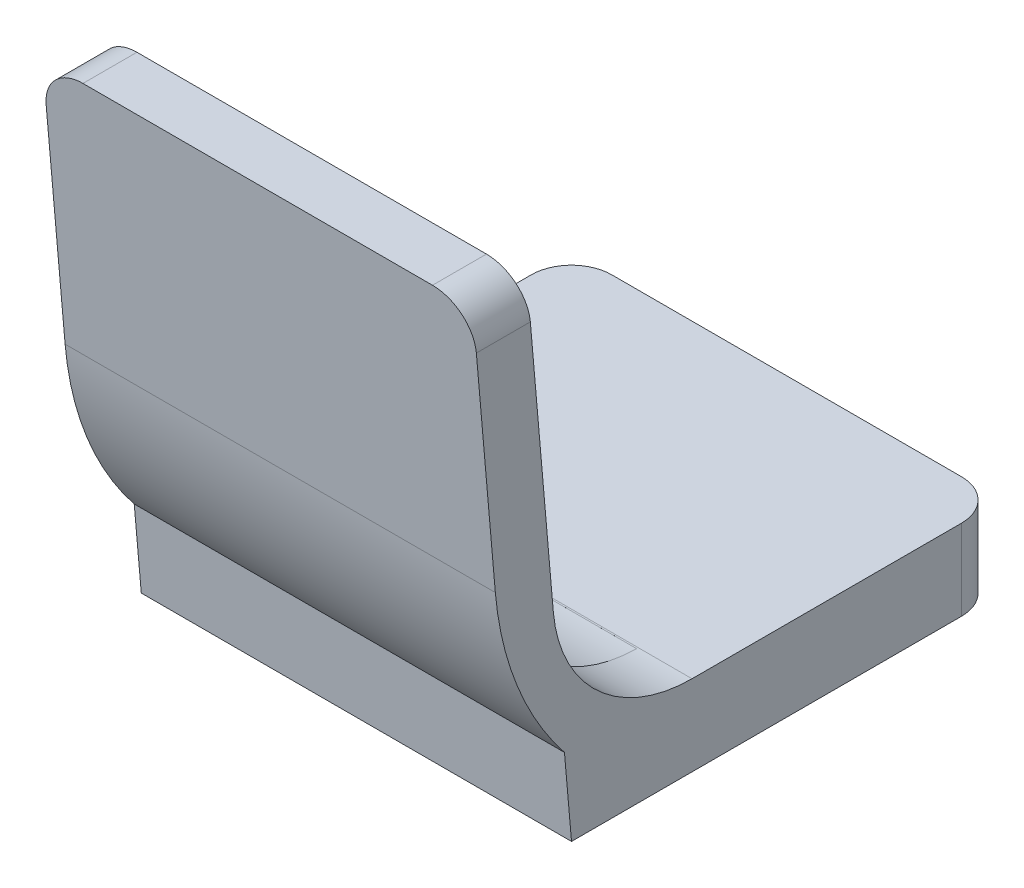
ISO-10303-21;
HEADER;
FILE_DESCRIPTION(('STEP AP214'),'2;1');
FILE_NAME('part.step','',(''),(''),'','','');
FILE_SCHEMA(('AUTOMOTIVE_DESIGN { 1 0 10303 214 1 1 1 1 }'));
ENDSEC;
DATA;
#1=APPLICATION_CONTEXT('core data for automotive mechanical design processes');
#2=APPLICATION_PROTOCOL_DEFINITION('international standard','automotive_design',2000,#1);
#3=PRODUCT_CONTEXT('',#1,'mechanical');
#4=PRODUCT('Part','Part','',(#3));
#5=PRODUCT_RELATED_PRODUCT_CATEGORY('part','',(#4));
#6=PRODUCT_DEFINITION_FORMATION('','',#4);
#7=PRODUCT_DEFINITION_CONTEXT('part definition',#1,'design');
#8=PRODUCT_DEFINITION('design','',#6,#7);
#9=PRODUCT_DEFINITION_SHAPE('','',#8);
#10=(LENGTH_UNIT() NAMED_UNIT(*) SI_UNIT(.MILLI.,.METRE.));
#11=(NAMED_UNIT(*) PLANE_ANGLE_UNIT() SI_UNIT($,.RADIAN.));
#12=(NAMED_UNIT(*) SI_UNIT($,.STERADIAN.) SOLID_ANGLE_UNIT());
#13=UNCERTAINTY_MEASURE_WITH_UNIT(LENGTH_MEASURE(1.E-05),#10,'distance_accuracy_value','');
#14=(GEOMETRIC_REPRESENTATION_CONTEXT(3) GLOBAL_UNCERTAINTY_ASSIGNED_CONTEXT((#13)) GLOBAL_UNIT_ASSIGNED_CONTEXT((#10,
#11,#12)) REPRESENTATION_CONTEXT('',''));
#15=CARTESIAN_POINT('',(0.,0.,0.));
#16=DIRECTION('',(0.,0.,1.));
#17=DIRECTION('',(1.,0.,0.));
#18=AXIS2_PLACEMENT_3D('',#15,#16,#17);
#19=CARTESIAN_POINT('',(8.,5.17827203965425,-4.48254610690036));
#20=DIRECTION('',(-1.,0.,0.));
#21=DIRECTION('',(0.,0.,1.));
#22=AXIS2_PLACEMENT_3D('',#19,#20,#21);
#23=CYLINDRICAL_SURFACE('',#22,5.17827203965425);
#24=CARTESIAN_POINT('',(-6.,5.17827203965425,-4.48254610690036));
#25=DIRECTION('',(1.,0.,0.));
#26=DIRECTION('',(0.,0.,-1.));
#27=AXIS2_PLACEMENT_3D('',#24,#25,#26);
#28=CIRCLE('',#27,5.17827203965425);
#29=CARTESIAN_POINT('',(-6.,0.000374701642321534,-4.42025265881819));
#30=VERTEX_POINT('',#29);
#31=CARTESIAN_POINT('',(-6.,4.72695589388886,0.676021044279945));
#32=VERTEX_POINT('',#31);
#33=EDGE_CURVE('E226',#30,#32,#28,.F.);
#34=ORIENTED_EDGE('',*,*,#33,.F.);
#35=DIRECTION('',(-1.,0.,0.));
#36=VECTOR('',#35,1.);
#37=CARTESIAN_POINT('',(8.,0.000374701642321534,-4.42025265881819));
#38=LINE('',#37,#36);
#39=CARTESIAN_POINT('',(6.,0.000374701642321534,-4.42025265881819));
#40=VERTEX_POINT('',#39);
#41=EDGE_CURVE('E219',#30,#40,#38,.F.);
#42=ORIENTED_EDGE('',*,*,#41,.T.);
#43=CARTESIAN_POINT('',(6.,5.17827203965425,-4.48254610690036));
#44=DIRECTION('',(1.,0.,0.));
#45=DIRECTION('',(0.,0.,-1.));
#46=AXIS2_PLACEMENT_3D('',#43,#44,#45);
#47=CIRCLE('',#46,5.17827203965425);
#48=CARTESIAN_POINT('',(6.,4.72695589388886,0.676021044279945));
#49=VERTEX_POINT('',#48);
#50=EDGE_CURVE('E223',#40,#49,#47,.F.);
#51=ORIENTED_EDGE('',*,*,#50,.T.);
#52=DIRECTION('',(-1.,0.,0.));
#53=VECTOR('',#52,1.);
#54=CARTESIAN_POINT('',(8.,4.72695589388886,0.676021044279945));
#55=LINE('',#54,#53);
#56=CARTESIAN_POINT('',(8.,4.72695589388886,0.676021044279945));
#57=VERTEX_POINT('',#56);
#58=EDGE_CURVE('E322',#57,#49,#55,.T.);
#59=ORIENTED_EDGE('',*,*,#58,.F.);
#60=CARTESIAN_POINT('',(8.,5.17827203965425,-4.48254610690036));
#61=DIRECTION('',(-1.,0.,0.));
#62=DIRECTION('',(0.,0.,-1.));
#63=AXIS2_PLACEMENT_3D('',#60,#61,#62);
#64=CIRCLE('',#63,5.17827203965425);
#65=CARTESIAN_POINT('',(8.,0.,-4.48254610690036));
#66=VERTEX_POINT('',#65);
#67=EDGE_CURVE('E275',#66,#57,#64,.T.);
#68=ORIENTED_EDGE('',*,*,#67,.F.);
#69=DIRECTION('',(-1.,0.,0.));
#70=VECTOR('',#69,1.);
#71=CARTESIAN_POINT('',(8.,0.,-4.48254610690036));
#72=LINE('',#71,#70);
#73=CARTESIAN_POINT('',(-8.,0.,-4.48254610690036));
#74=VERTEX_POINT('',#73);
#75=EDGE_CURVE('E325',#66,#74,#72,.T.);
#76=ORIENTED_EDGE('',*,*,#75,.T.);
#77=CARTESIAN_POINT('',(-8.,5.17827203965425,-4.48254610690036));
#78=DIRECTION('',(-1.,0.,0.));
#79=DIRECTION('',(0.,0.,-1.));
#80=AXIS2_PLACEMENT_3D('',#77,#78,#79);
#81=CIRCLE('',#80,5.17827203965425);
#82=CARTESIAN_POINT('',(-8.,4.72695589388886,0.676021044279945));
#83=VERTEX_POINT('',#82);
#84=EDGE_CURVE('E292',#74,#83,#81,.T.);
#85=ORIENTED_EDGE('',*,*,#84,.T.);
#86=EDGE_CURVE('E321',#32,#83,#55,.T.);
#87=ORIENTED_EDGE('',*,*,#86,.F.);
#88=EDGE_LOOP('',(#34,#42,#51,#59,#68,#76,#85,#87));
#89=FACE_BOUND('',#88,.T.);
#90=ADVANCED_FACE('F34',(#89),#23,.F.);
#91=CARTESIAN_POINT('',(8.,4.72695589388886,0.676021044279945));
#92=DIRECTION('',(0.,-0.0871557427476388,0.996194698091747));
#93=DIRECTION('',(0.,-0.996194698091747,-0.0871557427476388));
#94=AXIS2_PLACEMENT_3D('',#91,#92,#93);
#95=PLANE('',#94);
#96=DIRECTION('',(0.,0.996194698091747,0.0871557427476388));
#97=VECTOR('',#96,1.);
#98=CARTESIAN_POINT('',(-8.,4.72695589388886,0.676021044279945));
#99=LINE('',#98,#97);
#100=CARTESIAN_POINT('',(-8.,14.5,1.53105161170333));
#101=VERTEX_POINT('',#100);
#102=EDGE_CURVE('E295',#83,#101,#99,.T.);
#103=ORIENTED_EDGE('',*,*,#102,.T.);
#104=CARTESIAN_POINT('',(-6.5,14.5,1.53105161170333));
#105=DIRECTION('',(0.,-0.0871557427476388,0.996194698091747));
#106=DIRECTION('',(0.,0.996194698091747,0.0871557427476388));
#107=AXIS2_PLACEMENT_3D('',#104,#105,#106);
#108=ELLIPSE('',#107,1.50572975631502,1.5);
#109=CARTESIAN_POINT('',(-6.5,16.,1.66228460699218));
#110=VERTEX_POINT('',#109);
#111=EDGE_CURVE('E356',#101,#110,#108,.F.);
#112=ORIENTED_EDGE('',*,*,#111,.T.);
#113=DIRECTION('',(-1.,0.,0.));
#114=VECTOR('',#113,1.);
#115=CARTESIAN_POINT('',(8.,16.,1.66228460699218));
#116=LINE('',#115,#114);
#117=CARTESIAN_POINT('',(-6.,16.,1.66228460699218));
#118=VERTEX_POINT('',#117);
#119=EDGE_CURVE('E318',#118,#110,#116,.T.);
#120=ORIENTED_EDGE('',*,*,#119,.F.);
#121=DIRECTION('',(0.,0.996194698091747,0.0871557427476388));
#122=VECTOR('',#121,1.);
#123=CARTESIAN_POINT('',(-6.,4.72695589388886,0.676021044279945));
#124=LINE('',#123,#122);
#125=EDGE_CURVE('E203',#32,#118,#124,.T.);
#126=ORIENTED_EDGE('',*,*,#125,.F.);
#127=ORIENTED_EDGE('',*,*,#86,.T.);
#128=EDGE_LOOP('',(#103,#112,#120,#126,#127));
#129=FACE_BOUND('',#128,.T.);
#130=ADVANCED_FACE('F398',(#129),#95,.F.);
#131=CARTESIAN_POINT('',(8.,0.,-16.));
#132=DIRECTION('',(0.,0.,1.));
#133=DIRECTION('',(1.,0.,0.));
#134=AXIS2_PLACEMENT_3D('',#131,#132,#133);
#135=PLANE('',#134);
#136=DIRECTION('',(-1.,0.,0.));
#137=VECTOR('',#136,1.);
#138=CARTESIAN_POINT('',(8.,0.,-16.));
#139=LINE('',#138,#137);
#140=CARTESIAN_POINT('',(6.5,0.,-16.));
#141=VERTEX_POINT('',#140);
#142=CARTESIAN_POINT('',(-6.5,0.,-16.));
#143=VERTEX_POINT('',#142);
#144=EDGE_CURVE('E328',#141,#143,#139,.T.);
#145=ORIENTED_EDGE('',*,*,#144,.F.);
#146=DIRECTION('',(0.,1.,0.));
#147=VECTOR('',#146,1.);
#148=CARTESIAN_POINT('',(6.5,-3.,-16.));
#149=LINE('',#148,#147);
#150=CARTESIAN_POINT('',(6.5,-3.,-16.));
#151=VERTEX_POINT('',#150);
#152=EDGE_CURVE('E55',#141,#151,#149,.F.);
#153=ORIENTED_EDGE('',*,*,#152,.T.);
#154=DIRECTION('',(-1.,0.,0.));
#155=VECTOR('',#154,1.);
#156=CARTESIAN_POINT('',(8.,-3.,-16.));
#157=LINE('',#156,#155);
#158=CARTESIAN_POINT('',(-6.5,-3.,-16.));
#159=VERTEX_POINT('',#158);
#160=EDGE_CURVE('E290',#151,#159,#157,.T.);
#161=ORIENTED_EDGE('',*,*,#160,.T.);
#162=DIRECTION('',(0.,1.,0.));
#163=VECTOR('',#162,1.);
#164=CARTESIAN_POINT('',(-6.5,0.,-16.));
#165=LINE('',#164,#163);
#166=EDGE_CURVE('E362',#159,#143,#165,.T.);
#167=ORIENTED_EDGE('',*,*,#166,.T.);
#168=EDGE_LOOP('',(#145,#153,#161,#167));
#169=FACE_BOUND('',#168,.T.);
#170=ADVANCED_FACE('F366',(#169),#135,.F.);
#171=CARTESIAN_POINT('',(8.,0.,-16.));
#172=DIRECTION('',(0.,-1.,0.));
#173=DIRECTION('',(0.,0.,-1.));
#174=AXIS2_PLACEMENT_3D('',#171,#172,#173);
#175=PLANE('',#174);
#176=DIRECTION('',(0.,0.,1.));
#177=VECTOR('',#176,1.);
#178=CARTESIAN_POINT('',(8.,0.,-16.));
#179=LINE('',#178,#177);
#180=CARTESIAN_POINT('',(8.,0.,-14.5));
#181=VERTEX_POINT('',#180);
#182=EDGE_CURVE('E273',#181,#66,#179,.T.);
#183=ORIENTED_EDGE('',*,*,#182,.F.);
#184=CARTESIAN_POINT('',(6.5,0.,-14.5));
#185=DIRECTION('',(0.,-1.,0.));
#186=DIRECTION('',(0.,0.,-1.));
#187=AXIS2_PLACEMENT_3D('',#184,#185,#186);
#188=CIRCLE('',#187,1.5);
#189=EDGE_CURVE('E360',#181,#141,#188,.F.);
#190=ORIENTED_EDGE('',*,*,#189,.T.);
#191=ORIENTED_EDGE('',*,*,#144,.T.);
#192=CARTESIAN_POINT('',(-6.5,0.,-14.5));
#193=DIRECTION('',(0.,-1.,0.));
#194=DIRECTION('',(0.,0.,-1.));
#195=AXIS2_PLACEMENT_3D('',#192,#193,#194);
#196=CIRCLE('',#195,1.5);
#197=CARTESIAN_POINT('',(-8.,0.,-14.5));
#198=VERTEX_POINT('',#197);
#199=EDGE_CURVE('E358',#143,#198,#196,.F.);
#200=ORIENTED_EDGE('',*,*,#199,.T.);
#201=DIRECTION('',(0.,0.,1.));
#202=VECTOR('',#201,1.);
#203=CARTESIAN_POINT('',(-8.,0.,-16.));
#204=LINE('',#203,#202);
#205=EDGE_CURVE('E266',#198,#74,#204,.T.);
#206=ORIENTED_EDGE('',*,*,#205,.T.);
#207=ORIENTED_EDGE('',*,*,#75,.F.);
#208=EDGE_LOOP('',(#183,#190,#191,#200,#206,#207));
#209=FACE_BOUND('',#208,.T.);
#210=ADVANCED_FACE('F370',(#209),#175,.F.);
#211=CARTESIAN_POINT('',(6.5,16.,1.66228460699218));
#212=VERTEX_POINT('',#211);
#213=CARTESIAN_POINT('',(6.,16.,1.66228460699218));
#214=VERTEX_POINT('',#213);
#215=EDGE_CURVE('E319',#212,#214,#116,.T.);
#216=ORIENTED_EDGE('',*,*,#215,.F.);
#217=CARTESIAN_POINT('',(6.5,14.5,1.53105161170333));
#218=DIRECTION('',(0.,-0.0871557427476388,0.996194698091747));
#219=DIRECTION('',(0.,-0.996194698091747,-0.0871557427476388));
#220=AXIS2_PLACEMENT_3D('',#217,#218,#219);
#221=ELLIPSE('',#220,1.50572975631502,1.5);
#222=CARTESIAN_POINT('',(8.,14.5,1.53105161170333));
#223=VERTEX_POINT('',#222);
#224=EDGE_CURVE('E350',#212,#223,#221,.F.);
#225=ORIENTED_EDGE('',*,*,#224,.T.);
#226=DIRECTION('',(0.,0.996194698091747,0.0871557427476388));
#227=VECTOR('',#226,1.);
#228=CARTESIAN_POINT('',(8.,4.72695589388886,0.676021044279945));
#229=LINE('',#228,#227);
#230=EDGE_CURVE('E278',#57,#223,#229,.T.);
#231=ORIENTED_EDGE('',*,*,#230,.F.);
#232=ORIENTED_EDGE('',*,*,#58,.T.);
#233=DIRECTION('',(0.,0.996194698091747,0.0871557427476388));
#234=VECTOR('',#233,1.);
#235=CARTESIAN_POINT('',(6.,4.72695589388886,0.676021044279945));
#236=LINE('',#235,#234);
#237=EDGE_CURVE('E331',#49,#214,#236,.T.);
#238=ORIENTED_EDGE('',*,*,#237,.T.);
#239=EDGE_LOOP('',(#216,#225,#231,#232,#238));
#240=FACE_BOUND('',#239,.T.);
#241=ADVANCED_FACE('F406',(#240),#95,.F.);
#242=CARTESIAN_POINT('',(8.,16.,1.66228460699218));
#243=DIRECTION('',(0.,-1.,0.));
#244=DIRECTION('',(0.,0.,-1.));
#245=AXIS2_PLACEMENT_3D('',#242,#243,#244);
#246=PLANE('',#245);
#247=DIRECTION('',(-1.,0.,0.));
#248=VECTOR('',#247,1.);
#249=CARTESIAN_POINT('',(8.,16.,3.66992428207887));
#250=LINE('',#249,#248);
#251=CARTESIAN_POINT('',(6.5,16.,3.66992428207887));
#252=VERTEX_POINT('',#251);
#253=CARTESIAN_POINT('',(-6.5,16.,3.66992428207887));
#254=VERTEX_POINT('',#253);
#255=EDGE_CURVE('E315',#252,#254,#250,.T.);
#256=ORIENTED_EDGE('',*,*,#255,.F.);
#257=DIRECTION('',(0.,0.,1.));
#258=VECTOR('',#257,1.);
#259=CARTESIAN_POINT('',(6.5,16.,1.66228460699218));
#260=LINE('',#259,#258);
#261=EDGE_CURVE('E348',#252,#212,#260,.F.);
#262=ORIENTED_EDGE('',*,*,#261,.T.);
#263=ORIENTED_EDGE('',*,*,#215,.T.);
#264=DIRECTION('',(1.,0.,0.));
#265=VECTOR('',#264,1.);
#266=CARTESIAN_POINT('',(-6.,16.,1.66228460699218));
#267=LINE('',#266,#265);
#268=EDGE_CURVE('E195',#118,#214,#267,.T.);
#269=ORIENTED_EDGE('',*,*,#268,.F.);
#270=ORIENTED_EDGE('',*,*,#119,.T.);
#271=DIRECTION('',(0.,0.,1.));
#272=VECTOR('',#271,1.);
#273=CARTESIAN_POINT('',(-6.5,16.,1.66228460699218));
#274=LINE('',#273,#272);
#275=EDGE_CURVE('E345',#110,#254,#274,.T.);
#276=ORIENTED_EDGE('',*,*,#275,.T.);
#277=EDGE_LOOP('',(#256,#262,#263,#269,#270,#276));
#278=FACE_BOUND('',#277,.T.);
#279=ADVANCED_FACE('F430',(#278),#246,.F.);
#280=CARTESIAN_POINT('',(8.,6.43369657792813,2.83298118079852));
#281=DIRECTION('',(0.,0.0871557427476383,-0.996194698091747));
#282=DIRECTION('',(0.,0.996194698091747,0.0871557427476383));
#283=AXIS2_PLACEMENT_3D('',#280,#281,#282);
#284=PLANE('',#283);
#285=DIRECTION('',(0.,-0.996194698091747,-0.0871557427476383));
#286=VECTOR('',#285,1.);
#287=CARTESIAN_POINT('',(8.,6.43369657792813,2.83298118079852));
#288=LINE('',#287,#286);
#289=CARTESIAN_POINT('',(8.,14.5,3.53869128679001));
#290=VERTEX_POINT('',#289);
#291=CARTESIAN_POINT('',(8.,6.43369657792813,2.83298118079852));
#292=VERTEX_POINT('',#291);
#293=EDGE_CURVE('E281',#290,#292,#288,.T.);
#294=ORIENTED_EDGE('',*,*,#293,.F.);
#295=CARTESIAN_POINT('',(6.5,14.5,3.53869128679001));
#296=DIRECTION('',(0.,0.0871557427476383,-0.996194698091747));
#297=DIRECTION('',(0.,-0.996194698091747,-0.0871557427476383));
#298=AXIS2_PLACEMENT_3D('',#295,#296,#297);
#299=ELLIPSE('',#298,1.50572975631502,1.5);
#300=EDGE_CURVE('E343',#290,#252,#299,.F.);
#301=ORIENTED_EDGE('',*,*,#300,.T.);
#302=ORIENTED_EDGE('',*,*,#255,.T.);
#303=CARTESIAN_POINT('',(-6.5,14.5,3.53869128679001));
#304=DIRECTION('',(0.,0.0871557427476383,-0.996194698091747));
#305=DIRECTION('',(0.,0.996194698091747,0.0871557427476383));
#306=AXIS2_PLACEMENT_3D('',#303,#304,#305);
#307=ELLIPSE('',#306,1.50572975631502,1.5);
#308=CARTESIAN_POINT('',(-8.,14.5,3.53869128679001));
#309=VERTEX_POINT('',#308);
#310=EDGE_CURVE('E341',#254,#309,#307,.F.);
#311=ORIENTED_EDGE('',*,*,#310,.T.);
#312=DIRECTION('',(0.,-0.996194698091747,-0.0871557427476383));
#313=VECTOR('',#312,1.);
#314=CARTESIAN_POINT('',(-8.,6.43369657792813,2.83298118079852));
#315=LINE('',#314,#313);
#316=CARTESIAN_POINT('',(-8.,6.43369657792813,2.83298118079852));
#317=VERTEX_POINT('',#316);
#318=EDGE_CURVE('E298',#309,#317,#315,.T.);
#319=ORIENTED_EDGE('',*,*,#318,.T.);
#320=DIRECTION('',(-1.,0.,0.));
#321=VECTOR('',#320,1.);
#322=CARTESIAN_POINT('',(8.,6.43369657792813,2.83298118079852));
#323=LINE('',#322,#321);
#324=EDGE_CURVE('E312',#292,#317,#323,.T.);
#325=ORIENTED_EDGE('',*,*,#324,.F.);
#326=EDGE_LOOP('',(#294,#301,#302,#311,#319,#325));
#327=FACE_BOUND('',#326,.T.);
#328=ADVANCED_FACE('F446',(#327),#284,.F.);
#329=CARTESIAN_POINT('',(8.,7.47956549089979,-9.12135519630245));
#330=DIRECTION('',(-1.,0.,0.));
#331=DIRECTION('',(0.,0.,1.));
#332=AXIS2_PLACEMENT_3D('',#329,#330,#331);
#333=CYLINDRICAL_SURFACE('',#332,12.);
#334=CARTESIAN_POINT('',(-8.,7.47956549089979,-9.12135519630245));
#335=DIRECTION('',(1.,0.,0.));
#336=DIRECTION('',(0.,0.,-1.));
#337=AXIS2_PLACEMENT_3D('',#334,#335,#336);
#338=CIRCLE('',#337,12.);
#339=CARTESIAN_POINT('',(-8.,0.,0.262465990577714));
#340=VERTEX_POINT('',#339);
#341=EDGE_CURVE('E300',#317,#340,#338,.T.);
#342=ORIENTED_EDGE('',*,*,#341,.T.);
#343=DIRECTION('',(-1.,0.,0.));
#344=VECTOR('',#343,1.);
#345=CARTESIAN_POINT('',(8.,0.,0.262465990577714));
#346=LINE('',#345,#344);
#347=CARTESIAN_POINT('',(8.,0.,0.262465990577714));
#348=VERTEX_POINT('',#347);
#349=EDGE_CURVE('E309',#348,#340,#346,.T.);
#350=ORIENTED_EDGE('',*,*,#349,.F.);
#351=CARTESIAN_POINT('',(8.,7.47956549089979,-9.12135519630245));
#352=DIRECTION('',(1.,0.,0.));
#353=DIRECTION('',(0.,0.,-1.));
#354=AXIS2_PLACEMENT_3D('',#351,#352,#353);
#355=CIRCLE('',#354,12.);
#356=EDGE_CURVE('E283',#292,#348,#355,.T.);
#357=ORIENTED_EDGE('',*,*,#356,.F.);
#358=ORIENTED_EDGE('',*,*,#324,.T.);
#359=EDGE_LOOP('',(#342,#350,#357,#358));
#360=FACE_BOUND('',#359,.T.);
#361=ADVANCED_FACE('F449',(#360),#333,.T.);
#362=CARTESIAN_POINT('',(8.,-3.,0.));
#363=DIRECTION('',(0.,0.0871557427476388,-0.996194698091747));
#364=DIRECTION('',(0.,0.996194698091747,0.0871557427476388));
#365=AXIS2_PLACEMENT_3D('',#362,#363,#364);
#366=PLANE('',#365);
#367=DIRECTION('',(0.,-0.996194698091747,-0.0871557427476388));
#368=VECTOR('',#367,1.);
#369=CARTESIAN_POINT('',(-8.,-3.,0.));
#370=LINE('',#369,#368);
#371=CARTESIAN_POINT('',(-8.,-3.,0.));
#372=VERTEX_POINT('',#371);
#373=EDGE_CURVE('E302',#340,#372,#370,.T.);
#374=ORIENTED_EDGE('',*,*,#373,.T.);
#375=DIRECTION('',(-1.,0.,0.));
#376=VECTOR('',#375,1.);
#377=CARTESIAN_POINT('',(8.,-3.,0.));
#378=LINE('',#377,#376);
#379=CARTESIAN_POINT('',(8.,-3.,0.));
#380=VERTEX_POINT('',#379);
#381=EDGE_CURVE('E306',#380,#372,#378,.T.);
#382=ORIENTED_EDGE('',*,*,#381,.F.);
#383=DIRECTION('',(0.,-0.996194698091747,-0.0871557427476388));
#384=VECTOR('',#383,1.);
#385=CARTESIAN_POINT('',(8.,-3.,0.));
#386=LINE('',#385,#384);
#387=EDGE_CURVE('E285',#348,#380,#386,.T.);
#388=ORIENTED_EDGE('',*,*,#387,.F.);
#389=ORIENTED_EDGE('',*,*,#349,.T.);
#390=EDGE_LOOP('',(#374,#382,#388,#389));
#391=FACE_BOUND('',#390,.T.);
#392=ADVANCED_FACE('F453',(#391),#366,.F.);
#393=CARTESIAN_POINT('',(8.,-3.,-16.));
#394=DIRECTION('',(0.,1.,0.));
#395=DIRECTION('',(0.,0.,1.));
#396=AXIS2_PLACEMENT_3D('',#393,#394,#395);
#397=PLANE('',#396);
#398=DIRECTION('',(-1.,0.,0.));
#399=VECTOR('',#398,1.);
#400=CARTESIAN_POINT('',(7.,-3.,-1.));
#401=LINE('',#400,#399);
#402=CARTESIAN_POINT('',(7.,-3.,-0.999999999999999));
#403=VERTEX_POINT('',#402);
#404=CARTESIAN_POINT('',(-7.,-3.,-1.));
#405=VERTEX_POINT('',#404);
#406=EDGE_CURVE('E256',#403,#405,#401,.T.);
#407=ORIENTED_EDGE('',*,*,#406,.F.);
#408=DIRECTION('',(0.,0.,1.));
#409=VECTOR('',#408,1.);
#410=CARTESIAN_POINT('',(7.,-3.,-1.));
#411=LINE('',#410,#409);
#412=CARTESIAN_POINT('',(7.,-3.,-15.));
#413=VERTEX_POINT('',#412);
#414=EDGE_CURVE('E238',#413,#403,#411,.T.);
#415=ORIENTED_EDGE('',*,*,#414,.F.);
#416=DIRECTION('',(1.,0.,0.));
#417=VECTOR('',#416,1.);
#418=CARTESIAN_POINT('',(7.,-3.,-15.));
#419=LINE('',#418,#417);
#420=CARTESIAN_POINT('',(-7.,-3.,-15.));
#421=VERTEX_POINT('',#420);
#422=EDGE_CURVE('E245',#421,#413,#419,.T.);
#423=ORIENTED_EDGE('',*,*,#422,.F.);
#424=DIRECTION('',(0.,0.,-1.));
#425=VECTOR('',#424,1.);
#426=CARTESIAN_POINT('',(-7.,-3.,-1.));
#427=LINE('',#426,#425);
#428=EDGE_CURVE('E259',#405,#421,#427,.T.);
#429=ORIENTED_EDGE('',*,*,#428,.F.);
#430=EDGE_LOOP('',(#407,#415,#423,#429));
#431=FACE_BOUND('',#430,.T.);
#432=ORIENTED_EDGE('',*,*,#160,.F.);
#433=CARTESIAN_POINT('',(6.5,-3.,-14.5));
#434=DIRECTION('',(0.,1.,0.));
#435=DIRECTION('',(0.,0.,1.));
#436=AXIS2_PLACEMENT_3D('',#433,#434,#435);
#437=CIRCLE('',#436,1.5);
#438=CARTESIAN_POINT('',(8.,-3.,-14.5));
#439=VERTEX_POINT('',#438);
#440=EDGE_CURVE('E11',#151,#439,#437,.F.);
#441=ORIENTED_EDGE('',*,*,#440,.T.);
#442=DIRECTION('',(0.,0.,-1.));
#443=VECTOR('',#442,1.);
#444=CARTESIAN_POINT('',(8.,-3.,-16.));
#445=LINE('',#444,#443);
#446=EDGE_CURVE('E287',#380,#439,#445,.T.);
#447=ORIENTED_EDGE('',*,*,#446,.F.);
#448=ORIENTED_EDGE('',*,*,#381,.T.);
#449=DIRECTION('',(0.,0.,-1.));
#450=VECTOR('',#449,1.);
#451=CARTESIAN_POINT('',(-8.,-3.,-16.));
#452=LINE('',#451,#450);
#453=CARTESIAN_POINT('',(-8.,-3.,-14.5));
#454=VERTEX_POINT('',#453);
#455=EDGE_CURVE('E276',#372,#454,#452,.T.);
#456=ORIENTED_EDGE('',*,*,#455,.T.);
#457=CARTESIAN_POINT('',(-6.5,-3.,-14.5));
#458=DIRECTION('',(0.,1.,0.));
#459=DIRECTION('',(0.,0.,1.));
#460=AXIS2_PLACEMENT_3D('',#457,#458,#459);
#461=CIRCLE('',#460,1.5);
#462=EDGE_CURVE('E42',#454,#159,#461,.F.);
#463=ORIENTED_EDGE('',*,*,#462,.T.);
#464=EDGE_LOOP('',(#432,#441,#447,#448,#456,#463));
#465=FACE_BOUND('',#464,.T.);
#466=ADVANCED_FACE('F382',(#431,#465),#397,.F.);
#467=CARTESIAN_POINT('',(8.,7.47956549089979,-9.12135519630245));
#468=DIRECTION('',(1.,0.,0.));
#469=DIRECTION('',(0.,0.,-1.));
#470=AXIS2_PLACEMENT_3D('',#467,#468,#469);
#471=PLANE('',#470);
#472=ORIENTED_EDGE('',*,*,#230,.T.);
#473=DIRECTION('',(0.,0.,1.));
#474=VECTOR('',#473,1.);
#475=CARTESIAN_POINT('',(8.,14.5,3.66992428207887));
#476=LINE('',#475,#474);
#477=EDGE_CURVE('E338',#223,#290,#476,.T.);
#478=ORIENTED_EDGE('',*,*,#477,.T.);
#479=ORIENTED_EDGE('',*,*,#293,.T.);
#480=ORIENTED_EDGE('',*,*,#356,.T.);
#481=ORIENTED_EDGE('',*,*,#387,.T.);
#482=ORIENTED_EDGE('',*,*,#446,.T.);
#483=DIRECTION('',(0.,1.,0.));
#484=VECTOR('',#483,1.);
#485=CARTESIAN_POINT('',(8.,0.,-14.5));
#486=LINE('',#485,#484);
#487=EDGE_CURVE('E335',#439,#181,#486,.T.);
#488=ORIENTED_EDGE('',*,*,#487,.T.);
#489=ORIENTED_EDGE('',*,*,#182,.T.);
#490=ORIENTED_EDGE('',*,*,#67,.T.);
#491=EDGE_LOOP('',(#472,#478,#479,#480,#481,#482,#488,#489,#490));
#492=FACE_BOUND('',#491,.T.);
#493=ADVANCED_FACE('F378',(#492),#471,.T.);
#494=CARTESIAN_POINT('',(-8.,7.47956549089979,-9.12135519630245));
#495=DIRECTION('',(1.,0.,0.));
#496=DIRECTION('',(0.,0.,-1.));
#497=AXIS2_PLACEMENT_3D('',#494,#495,#496);
#498=PLANE('',#497);
#499=ORIENTED_EDGE('',*,*,#318,.F.);
#500=DIRECTION('',(0.,0.,1.));
#501=VECTOR('',#500,1.);
#502=CARTESIAN_POINT('',(-8.,14.5,-9.12135519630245));
#503=LINE('',#502,#501);
#504=EDGE_CURVE('E354',#309,#101,#503,.F.);
#505=ORIENTED_EDGE('',*,*,#504,.T.);
#506=ORIENTED_EDGE('',*,*,#102,.F.);
#507=ORIENTED_EDGE('',*,*,#84,.F.);
#508=ORIENTED_EDGE('',*,*,#205,.F.);
#509=DIRECTION('',(0.,1.,0.));
#510=VECTOR('',#509,1.);
#511=CARTESIAN_POINT('',(-8.,7.47956549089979,-14.5));
#512=LINE('',#511,#510);
#513=EDGE_CURVE('E352',#198,#454,#512,.F.);
#514=ORIENTED_EDGE('',*,*,#513,.T.);
#515=ORIENTED_EDGE('',*,*,#455,.F.);
#516=ORIENTED_EDGE('',*,*,#373,.F.);
#517=ORIENTED_EDGE('',*,*,#341,.F.);
#518=EDGE_LOOP('',(#499,#505,#506,#507,#508,#514,#515,#516,#517));
#519=FACE_BOUND('',#518,.T.);
#520=ADVANCED_FACE('F388',(#519),#498,.F.);
#521=CARTESIAN_POINT('',(7.,-1.,-1.));
#522=DIRECTION('',(1.,0.,0.));
#523=DIRECTION('',(0.,0.,-1.));
#524=AXIS2_PLACEMENT_3D('',#521,#522,#523);
#525=PLANE('',#524);
#526=ORIENTED_EDGE('',*,*,#414,.T.);
#527=DIRECTION('',(0.,-1.,0.));
#528=VECTOR('',#527,1.);
#529=CARTESIAN_POINT('',(7.,-1.,-1.));
#530=LINE('',#529,#528);
#531=CARTESIAN_POINT('',(7.,-1.,-1.));
#532=VERTEX_POINT('',#531);
#533=EDGE_CURVE('E254',#532,#403,#530,.T.);
#534=ORIENTED_EDGE('',*,*,#533,.F.);
#535=DIRECTION('',(0.,0.,1.));
#536=VECTOR('',#535,1.);
#537=CARTESIAN_POINT('',(7.,-1.,-1.));
#538=LINE('',#537,#536);
#539=CARTESIAN_POINT('',(7.,-1.,-15.));
#540=VERTEX_POINT('',#539);
#541=EDGE_CURVE('E241',#540,#532,#538,.T.);
#542=ORIENTED_EDGE('',*,*,#541,.F.);
#543=DIRECTION('',(0.,-1.,0.));
#544=VECTOR('',#543,1.);
#545=CARTESIAN_POINT('',(7.,-1.,-15.));
#546=LINE('',#545,#544);
#547=EDGE_CURVE('E264',#540,#413,#546,.T.);
#548=ORIENTED_EDGE('',*,*,#547,.T.);
#549=EDGE_LOOP('',(#526,#534,#542,#548));
#550=FACE_BOUND('',#549,.T.);
#551=ADVANCED_FACE('F613',(#550),#525,.F.);
#552=CARTESIAN_POINT('',(7.,-1.,-15.));
#553=DIRECTION('',(0.,0.,-1.));
#554=DIRECTION('',(0.,1.,0.));
#555=AXIS2_PLACEMENT_3D('',#552,#553,#554);
#556=PLANE('',#555);
#557=ORIENTED_EDGE('',*,*,#422,.T.);
#558=ORIENTED_EDGE('',*,*,#547,.F.);
#559=DIRECTION('',(1.,0.,0.));
#560=VECTOR('',#559,1.);
#561=CARTESIAN_POINT('',(7.,-1.,-15.));
#562=LINE('',#561,#560);
#563=CARTESIAN_POINT('',(-7.,-1.,-15.));
#564=VERTEX_POINT('',#563);
#565=EDGE_CURVE('E251',#564,#540,#562,.T.);
#566=ORIENTED_EDGE('',*,*,#565,.F.);
#567=DIRECTION('',(0.,-1.,0.));
#568=VECTOR('',#567,1.);
#569=CARTESIAN_POINT('',(-7.,-1.,-15.));
#570=LINE('',#569,#568);
#571=EDGE_CURVE('E267',#564,#421,#570,.T.);
#572=ORIENTED_EDGE('',*,*,#571,.T.);
#573=EDGE_LOOP('',(#557,#558,#566,#572));
#574=FACE_BOUND('',#573,.T.);
#575=ADVANCED_FACE('F603',(#574),#556,.F.);
#576=CARTESIAN_POINT('',(-7.,-1.,-1.));
#577=DIRECTION('',(-1.,0.,0.));
#578=DIRECTION('',(0.,0.,1.));
#579=AXIS2_PLACEMENT_3D('',#576,#577,#578);
#580=PLANE('',#579);
#581=ORIENTED_EDGE('',*,*,#428,.T.);
#582=ORIENTED_EDGE('',*,*,#571,.F.);
#583=DIRECTION('',(0.,0.,-1.));
#584=VECTOR('',#583,1.);
#585=CARTESIAN_POINT('',(-7.,-1.,-1.));
#586=LINE('',#585,#584);
#587=CARTESIAN_POINT('',(-7.,-1.,-1.));
#588=VERTEX_POINT('',#587);
#589=EDGE_CURVE('E248',#588,#564,#586,.T.);
#590=ORIENTED_EDGE('',*,*,#589,.F.);
#591=DIRECTION('',(0.,-1.,0.));
#592=VECTOR('',#591,1.);
#593=CARTESIAN_POINT('',(-7.,-1.,-1.));
#594=LINE('',#593,#592);
#595=EDGE_CURVE('E269',#588,#405,#594,.T.);
#596=ORIENTED_EDGE('',*,*,#595,.T.);
#597=EDGE_LOOP('',(#581,#582,#590,#596));
#598=FACE_BOUND('',#597,.T.);
#599=ADVANCED_FACE('F593',(#598),#580,.F.);
#600=CARTESIAN_POINT('',(7.,-1.,-1.));
#601=DIRECTION('',(0.,0.,1.));
#602=DIRECTION('',(0.,-1.,0.));
#603=AXIS2_PLACEMENT_3D('',#600,#601,#602);
#604=PLANE('',#603);
#605=ORIENTED_EDGE('',*,*,#406,.T.);
#606=ORIENTED_EDGE('',*,*,#595,.F.);
#607=DIRECTION('',(-1.,0.,0.));
#608=VECTOR('',#607,1.);
#609=CARTESIAN_POINT('',(7.,-1.,-1.));
#610=LINE('',#609,#608);
#611=EDGE_CURVE('E244',#532,#588,#610,.T.);
#612=ORIENTED_EDGE('',*,*,#611,.F.);
#613=ORIENTED_EDGE('',*,*,#533,.T.);
#614=EDGE_LOOP('',(#605,#606,#612,#613));
#615=FACE_BOUND('',#614,.T.);
#616=ADVANCED_FACE('F582',(#615),#604,.F.);
#617=CARTESIAN_POINT('',(7.,-1.,-15.));
#618=DIRECTION('',(0.,1.,0.));
#619=DIRECTION('',(0.,0.,1.));
#620=AXIS2_PLACEMENT_3D('',#617,#618,#619);
#621=PLANE('',#620);
#622=CARTESIAN_POINT('',(0.,-1.,-8.));
#623=DIRECTION('',(0.,-1.,0.));
#624=DIRECTION('',(0.,0.,-1.));
#625=AXIS2_PLACEMENT_3D('',#622,#623,#624);
#626=CIRCLE('',#625,3.);
#627=CARTESIAN_POINT('',(0.,-1.,-11.));
#628=VERTEX_POINT('',#627);
#629=EDGE_CURVE('E235',#628,#628,#626,.T.);
#630=ORIENTED_EDGE('',*,*,#629,.F.);
#631=EDGE_LOOP('',(#630));
#632=FACE_BOUND('',#631,.T.);
#633=ORIENTED_EDGE('',*,*,#541,.T.);
#634=ORIENTED_EDGE('',*,*,#611,.T.);
#635=ORIENTED_EDGE('',*,*,#589,.T.);
#636=ORIENTED_EDGE('',*,*,#565,.T.);
#637=EDGE_LOOP('',(#633,#634,#635,#636));
#638=FACE_BOUND('',#637,.T.);
#639=ADVANCED_FACE('F572',(#632,#638),#621,.F.);
#640=CARTESIAN_POINT('',(0.,-1.,-8.));
#641=DIRECTION('',(0.,-1.,0.));
#642=DIRECTION('',(0.,0.,-1.));
#643=AXIS2_PLACEMENT_3D('',#640,#641,#642);
#644=CYLINDRICAL_SURFACE('',#643,3.);
#645=ORIENTED_EDGE('',*,*,#629,.T.);
#646=EDGE_LOOP('',(#645));
#647=FACE_BOUND('',#646,.T.);
#648=CARTESIAN_POINT('',(0.,-3.,-8.));
#649=DIRECTION('',(0.,-1.,0.));
#650=DIRECTION('',(0.,0.,-1.));
#651=AXIS2_PLACEMENT_3D('',#648,#649,#650);
#652=CIRCLE('',#651,3.);
#653=CARTESIAN_POINT('',(0.,-3.,-11.));
#654=VERTEX_POINT('',#653);
#655=EDGE_CURVE('E232',#654,#654,#652,.T.);
#656=ORIENTED_EDGE('',*,*,#655,.F.);
#657=EDGE_LOOP('',(#656));
#658=FACE_BOUND('',#657,.T.);
#659=ADVANCED_FACE('F562',(#647,#658),#644,.T.);
#660=CARTESIAN_POINT('',(0.,-3.,-8.));
#661=DIRECTION('',(0.,-1.,0.));
#662=DIRECTION('',(0.,0.,-1.));
#663=AXIS2_PLACEMENT_3D('',#660,#661,#662);
#664=CIRCLE('',#663,2.5);
#665=CARTESIAN_POINT('',(0.,-3.,-10.5));
#666=VERTEX_POINT('',#665);
#667=EDGE_CURVE('E228',#666,#666,#664,.T.);
#668=ORIENTED_EDGE('',*,*,#667,.F.);
#669=EDGE_LOOP('',(#668));
#670=FACE_BOUND('',#669,.T.);
#671=ORIENTED_EDGE('',*,*,#655,.T.);
#672=EDGE_LOOP('',(#671));
#673=FACE_BOUND('',#672,.T.);
#674=ADVANCED_FACE('F462',(#670,#673),#397,.F.);
#675=CARTESIAN_POINT('',(0.,-1.,-8.));
#676=DIRECTION('',(0.,-1.,0.));
#677=DIRECTION('',(0.,0.,-1.));
#678=AXIS2_PLACEMENT_3D('',#675,#676,#677);
#679=CYLINDRICAL_SURFACE('',#678,2.5);
#680=CARTESIAN_POINT('',(0.,-1.,-8.));
#681=DIRECTION('',(0.,-1.,0.));
#682=DIRECTION('',(0.,0.,-1.));
#683=AXIS2_PLACEMENT_3D('',#680,#681,#682);
#684=CIRCLE('',#683,2.5);
#685=CARTESIAN_POINT('',(0.,-1.,-10.5));
#686=VERTEX_POINT('',#685);
#687=EDGE_CURVE('E229',#686,#686,#684,.T.);
#688=ORIENTED_EDGE('',*,*,#687,.F.);
#689=EDGE_LOOP('',(#688));
#690=FACE_BOUND('',#689,.T.);
#691=ORIENTED_EDGE('',*,*,#667,.T.);
#692=EDGE_LOOP('',(#691));
#693=FACE_BOUND('',#692,.T.);
#694=ADVANCED_FACE('F542',(#690,#693),#679,.F.);
#695=CARTESIAN_POINT('',(0.,-1.,-8.));
#696=DIRECTION('',(0.,-1.,0.));
#697=DIRECTION('',(0.,0.,-1.));
#698=AXIS2_PLACEMENT_3D('',#695,#696,#697);
#699=PLANE('',#698);
#700=ORIENTED_EDGE('',*,*,#687,.T.);
#701=EDGE_LOOP('',(#700));
#702=FACE_BOUND('',#701,.T.);
#703=ADVANCED_FACE('F530',(#702),#699,.T.);
#704=CARTESIAN_POINT('',(-6.,6.08267971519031,-4.42039510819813));
#705=DIRECTION('',(1.,0.,0.));
#706=DIRECTION('',(0.,0.,-1.));
#707=AXIS2_PLACEMENT_3D('',#704,#705,#706);
#708=PLANE('',#707);
#709=ORIENTED_EDGE('',*,*,#33,.T.);
#710=ORIENTED_EDGE('',*,*,#125,.T.);
#711=DIRECTION('',(0.,-1.,0.));
#712=VECTOR('',#711,1.);
#713=CARTESIAN_POINT('',(-6.,16.,1.66228460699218));
#714=LINE('',#713,#712);
#715=CARTESIAN_POINT('',(-6.,6.08267971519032,1.6622846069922));
#716=VERTEX_POINT('',#715);
#717=EDGE_CURVE('E186',#118,#716,#714,.T.);
#718=ORIENTED_EDGE('',*,*,#717,.T.);
#719=CARTESIAN_POINT('',(-6.,6.08267971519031,-4.42039510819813));
#720=DIRECTION('',(1.,0.,0.));
#721=DIRECTION('',(0.,0.,-1.));
#722=AXIS2_PLACEMENT_3D('',#719,#720,#721);
#723=CIRCLE('',#722,6.08267971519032);
#724=CARTESIAN_POINT('',(-6.,0.,-4.42039510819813));
#725=VERTEX_POINT('',#724);
#726=EDGE_CURVE('E201',#716,#725,#723,.T.);
#727=ORIENTED_EDGE('',*,*,#726,.T.);
#728=DIRECTION('',(0.,0.934731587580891,0.35535455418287));
#729=VECTOR('',#728,1.);
#730=CARTESIAN_POINT('',(-6.,0.,-4.42039510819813));
#731=LINE('',#730,#729);
#732=EDGE_CURVE('E205',#725,#30,#731,.T.);
#733=ORIENTED_EDGE('',*,*,#732,.T.);
#734=EDGE_LOOP('',(#709,#710,#718,#727,#733));
#735=FACE_BOUND('',#734,.T.);
#736=ADVANCED_FACE('F199',(#735),#708,.T.);
#737=CARTESIAN_POINT('',(6.,6.08267971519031,-4.42039510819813));
#738=DIRECTION('',(1.,0.,0.));
#739=DIRECTION('',(0.,0.,-1.));
#740=AXIS2_PLACEMENT_3D('',#737,#738,#739);
#741=PLANE('',#740);
#742=DIRECTION('',(0.,0.934731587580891,0.35535455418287));
#743=VECTOR('',#742,1.);
#744=CARTESIAN_POINT('',(6.,0.,-4.42039510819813));
#745=LINE('',#744,#743);
#746=CARTESIAN_POINT('',(6.,0.,-4.42039510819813));
#747=VERTEX_POINT('',#746);
#748=EDGE_CURVE('E213',#747,#40,#745,.T.);
#749=ORIENTED_EDGE('',*,*,#748,.F.);
#750=CARTESIAN_POINT('',(6.,6.08267971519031,-4.42039510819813));
#751=DIRECTION('',(1.,0.,0.));
#752=DIRECTION('',(0.,0.,-1.));
#753=AXIS2_PLACEMENT_3D('',#750,#751,#752);
#754=CIRCLE('',#753,6.08267971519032);
#755=CARTESIAN_POINT('',(6.,6.08267971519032,1.6622846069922));
#756=VERTEX_POINT('',#755);
#757=EDGE_CURVE('E217',#756,#747,#754,.T.);
#758=ORIENTED_EDGE('',*,*,#757,.F.);
#759=DIRECTION('',(0.,-1.,0.));
#760=VECTOR('',#759,1.);
#761=CARTESIAN_POINT('',(6.,16.,1.66228460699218));
#762=LINE('',#761,#760);
#763=EDGE_CURVE('E189',#214,#756,#762,.T.);
#764=ORIENTED_EDGE('',*,*,#763,.F.);
#765=ORIENTED_EDGE('',*,*,#237,.F.);
#766=ORIENTED_EDGE('',*,*,#50,.F.);
#767=EDGE_LOOP('',(#749,#758,#764,#765,#766));
#768=FACE_BOUND('',#767,.T.);
#769=ADVANCED_FACE('F434',(#768),#741,.F.);
#770=CARTESIAN_POINT('',(-6.,0.,-4.42039510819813));
#771=DIRECTION('',(0.,0.35535455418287,-0.934731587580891));
#772=DIRECTION('',(0.,0.934731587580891,0.35535455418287));
#773=AXIS2_PLACEMENT_3D('',#770,#771,#772);
#774=PLANE('',#773);
#775=ORIENTED_EDGE('',*,*,#732,.F.);
#776=DIRECTION('',(1.,0.,0.));
#777=VECTOR('',#776,1.);
#778=CARTESIAN_POINT('',(-6.,0.,-4.42039510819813));
#779=LINE('',#778,#777);
#780=EDGE_CURVE('E194',#725,#747,#779,.T.);
#781=ORIENTED_EDGE('',*,*,#780,.T.);
#782=ORIENTED_EDGE('',*,*,#748,.T.);
#783=ORIENTED_EDGE('',*,*,#41,.F.);
#784=EDGE_LOOP('',(#775,#781,#782,#783));
#785=FACE_BOUND('',#784,.T.);
#786=ADVANCED_FACE('F441',(#785),#774,.F.);
#787=CARTESIAN_POINT('',(-6.,6.08267971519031,-4.42039510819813));
#788=DIRECTION('',(1.,0.,0.));
#789=DIRECTION('',(0.,0.,-1.));
#790=AXIS2_PLACEMENT_3D('',#787,#788,#789);
#791=CYLINDRICAL_SURFACE('',#790,6.08267971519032);
#792=ORIENTED_EDGE('',*,*,#757,.T.);
#793=ORIENTED_EDGE('',*,*,#780,.F.);
#794=ORIENTED_EDGE('',*,*,#726,.F.);
#795=DIRECTION('',(1.,0.,0.));
#796=VECTOR('',#795,1.);
#797=CARTESIAN_POINT('',(-6.,6.08267971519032,1.6622846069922));
#798=LINE('',#797,#796);
#799=EDGE_CURVE('E182',#716,#756,#798,.T.);
#800=ORIENTED_EDGE('',*,*,#799,.T.);
#801=EDGE_LOOP('',(#792,#793,#794,#800));
#802=FACE_BOUND('',#801,.T.);
#803=ADVANCED_FACE('F207',(#802),#791,.F.);
#804=CARTESIAN_POINT('',(-6.,16.,1.66228460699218));
#805=DIRECTION('',(0.,0.,1.));
#806=DIRECTION('',(0.,-1.,0.));
#807=AXIS2_PLACEMENT_3D('',#804,#805,#806);
#808=PLANE('',#807);
#809=ORIENTED_EDGE('',*,*,#763,.T.);
#810=ORIENTED_EDGE('',*,*,#799,.F.);
#811=ORIENTED_EDGE('',*,*,#717,.F.);
#812=ORIENTED_EDGE('',*,*,#268,.T.);
#813=EDGE_LOOP('',(#809,#810,#811,#812));
#814=FACE_BOUND('',#813,.T.);
#815=ADVANCED_FACE('F184',(#814),#808,.F.);
#816=CARTESIAN_POINT('',(6.5,14.5,-9.12135519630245));
#817=DIRECTION('',(0.,0.,-1.));
#818=DIRECTION('',(-1.,0.,0.));
#819=AXIS2_PLACEMENT_3D('',#816,#817,#818);
#820=CYLINDRICAL_SURFACE('',#819,1.5);
#821=ORIENTED_EDGE('',*,*,#224,.F.);
#822=ORIENTED_EDGE('',*,*,#261,.F.);
#823=ORIENTED_EDGE('',*,*,#300,.F.);
#824=ORIENTED_EDGE('',*,*,#477,.F.);
#825=EDGE_LOOP('',(#821,#822,#823,#824));
#826=FACE_BOUND('',#825,.T.);
#827=ADVANCED_FACE('F414',(#826),#820,.T.);
#828=CARTESIAN_POINT('',(-6.5,14.5,1.66228460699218));
#829=DIRECTION('',(0.,0.,1.));
#830=DIRECTION('',(1.,0.,0.));
#831=AXIS2_PLACEMENT_3D('',#828,#829,#830);
#832=CYLINDRICAL_SURFACE('',#831,1.5);
#833=ORIENTED_EDGE('',*,*,#111,.F.);
#834=ORIENTED_EDGE('',*,*,#504,.F.);
#835=ORIENTED_EDGE('',*,*,#310,.F.);
#836=ORIENTED_EDGE('',*,*,#275,.F.);
#837=EDGE_LOOP('',(#833,#834,#835,#836));
#838=FACE_BOUND('',#837,.T.);
#839=ADVANCED_FACE('F396',(#838),#832,.T.);
#840=CARTESIAN_POINT('',(6.5,7.47956549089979,-14.5));
#841=DIRECTION('',(0.,-1.,0.));
#842=DIRECTION('',(0.,0.,-1.));
#843=AXIS2_PLACEMENT_3D('',#840,#841,#842);
#844=CYLINDRICAL_SURFACE('',#843,1.5);
#845=ORIENTED_EDGE('',*,*,#440,.F.);
#846=ORIENTED_EDGE('',*,*,#152,.F.);
#847=ORIENTED_EDGE('',*,*,#189,.F.);
#848=ORIENTED_EDGE('',*,*,#487,.F.);
#849=EDGE_LOOP('',(#845,#846,#847,#848));
#850=FACE_BOUND('',#849,.T.);
#851=ADVANCED_FACE('F376',(#850),#844,.T.);
#852=CARTESIAN_POINT('',(-6.5,0.,-14.5));
#853=DIRECTION('',(0.,1.,0.));
#854=DIRECTION('',(0.,0.,1.));
#855=AXIS2_PLACEMENT_3D('',#852,#853,#854);
#856=CYLINDRICAL_SURFACE('',#855,1.5);
#857=ORIENTED_EDGE('',*,*,#462,.F.);
#858=ORIENTED_EDGE('',*,*,#513,.F.);
#859=ORIENTED_EDGE('',*,*,#199,.F.);
#860=ORIENTED_EDGE('',*,*,#166,.F.);
#861=EDGE_LOOP('',(#857,#858,#859,#860));
#862=FACE_BOUND('',#861,.T.);
#863=ADVANCED_FACE('F36',(#862),#856,.T.);
#864=CLOSED_SHELL('',(#90,#130,#170,#210,#241,#279,#328,#361,#392,#466,#493,#520,#551,#575,#599,
#616,#639,#659,#674,#694,#703,#736,#769,#786,#803,#815,#827,#839,#851,#863));
#865=MANIFOLD_SOLID_BREP('B2',#864);
#866=ADVANCED_BREP_SHAPE_REPRESENTATION('',(#18,#865),#14);
#867=SHAPE_DEFINITION_REPRESENTATION(#9,#866);
ENDSEC;
END-ISO-10303-21;
